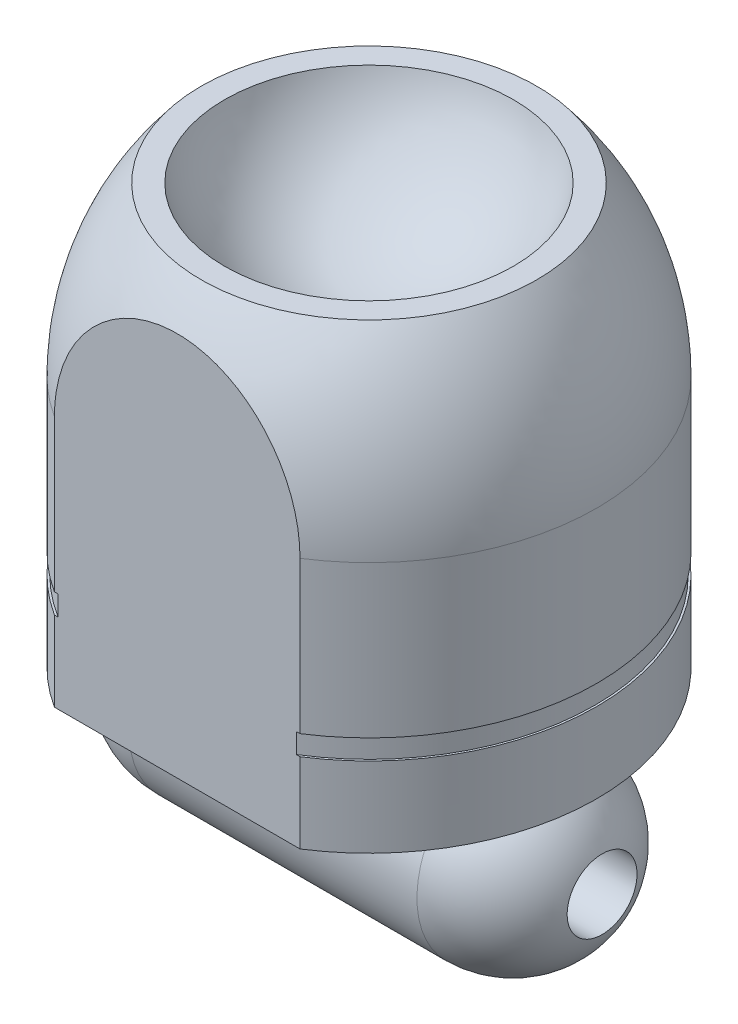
ISO-10303-21;
HEADER;
FILE_DESCRIPTION(('STEP AP214'),'2;1');
FILE_NAME('part.step','',(''),(''),'','','');
FILE_SCHEMA(('AUTOMOTIVE_DESIGN { 1 0 10303 214 1 1 1 1 }'));
ENDSEC;
DATA;
#1=APPLICATION_CONTEXT('core data for automotive mechanical design processes');
#2=APPLICATION_PROTOCOL_DEFINITION('international standard','automotive_design',2000,#1);
#3=PRODUCT_CONTEXT('',#1,'mechanical');
#4=PRODUCT('Part','Part','',(#3));
#5=PRODUCT_RELATED_PRODUCT_CATEGORY('part','',(#4));
#6=PRODUCT_DEFINITION_FORMATION('','',#4);
#7=PRODUCT_DEFINITION_CONTEXT('part definition',#1,'design');
#8=PRODUCT_DEFINITION('design','',#6,#7);
#9=PRODUCT_DEFINITION_SHAPE('','',#8);
#10=(LENGTH_UNIT() NAMED_UNIT(*) SI_UNIT(.MILLI.,.METRE.));
#11=(NAMED_UNIT(*) PLANE_ANGLE_UNIT() SI_UNIT($,.RADIAN.));
#12=(NAMED_UNIT(*) SI_UNIT($,.STERADIAN.) SOLID_ANGLE_UNIT());
#13=UNCERTAINTY_MEASURE_WITH_UNIT(LENGTH_MEASURE(1.E-05),#10,'distance_accuracy_value','');
#14=(GEOMETRIC_REPRESENTATION_CONTEXT(3) GLOBAL_UNCERTAINTY_ASSIGNED_CONTEXT((#13)) GLOBAL_UNIT_ASSIGNED_CONTEXT((#10,
#11,#12)) REPRESENTATION_CONTEXT('',''));
#15=CARTESIAN_POINT('',(0.,0.,0.));
#16=DIRECTION('',(0.,0.,1.));
#17=DIRECTION('',(1.,0.,0.));
#18=AXIS2_PLACEMENT_3D('',#15,#16,#17);
#19=CARTESIAN_POINT('',(0.,210.,0.));
#20=DIRECTION('',(0.,1.,0.));
#21=DIRECTION('',(-1.,0.,0.));
#22=AXIS2_PLACEMENT_3D('',#19,#20,#21);
#23=PLANE('',#22);
#24=CARTESIAN_POINT('',(0.,210.,0.));
#25=DIRECTION('',(0.,1.,0.));
#26=DIRECTION('',(-1.,0.,0.));
#27=AXIS2_PLACEMENT_3D('',#24,#25,#26);
#28=CIRCLE('',#27,84.);
#29=CARTESIAN_POINT('',(-84.,210.,0.));
#30=VERTEX_POINT('',#29);
#31=EDGE_CURVE('E255',#30,#30,#28,.T.);
#32=ORIENTED_EDGE('',*,*,#31,.T.);
#33=EDGE_LOOP('',(#32));
#34=FACE_BOUND('',#33,.T.);
#35=CARTESIAN_POINT('',(0.,210.,0.));
#36=DIRECTION('',(0.,1.,0.));
#37=DIRECTION('',(-1.,0.,0.));
#38=AXIS2_PLACEMENT_3D('',#35,#36,#37);
#39=CIRCLE('',#38,72.2841614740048);
#40=CARTESIAN_POINT('',(-72.2841614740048,210.,0.));
#41=VERTEX_POINT('',#40);
#42=EDGE_CURVE('E145',#41,#41,#39,.F.);
#43=ORIENTED_EDGE('',*,*,#42,.T.);
#44=EDGE_LOOP('',(#43));
#45=FACE_BOUND('',#44,.T.);
#46=ADVANCED_FACE('F40',(#34,#45),#23,.T.);
#47=CARTESIAN_POINT('',(0.,210.,0.));
#48=DIRECTION('',(0.,1.,0.));
#49=DIRECTION('',(-1.,0.,0.));
#50=AXIS2_PLACEMENT_3D('',#47,#48,#49);
#51=CYLINDRICAL_SURFACE('',#50,114.);
#52=CARTESIAN_POINT('',(0.,50.,0.));
#53=DIRECTION('',(0.,1.,0.));
#54=DIRECTION('',(-1.,0.,0.));
#55=AXIS2_PLACEMENT_3D('',#52,#53,#54);
#56=CIRCLE('',#55,114.);
#57=CARTESIAN_POINT('',(61.4817045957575,50.,96.));
#58=VERTEX_POINT('',#57);
#59=CARTESIAN_POINT('',(52.7205426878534,50.,-101.076923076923));
#60=VERTEX_POINT('',#59);
#61=EDGE_CURVE('E247',#58,#60,#56,.T.);
#62=ORIENTED_EDGE('',*,*,#61,.T.);
#63=CARTESIAN_POINT('',(0.,-169.,0.));
#64=DIRECTION('',(0.,-0.419058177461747,-0.907959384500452));
#65=DIRECTION('',(0.,0.907959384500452,-0.419058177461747));
#66=AXIS2_PLACEMENT_3D('',#63,#64,#65);
#67=ELLIPSE('',#66,272.038600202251,114.);
#68=CARTESIAN_POINT('',(-52.7205426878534,50.,-101.076923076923));
#69=VERTEX_POINT('',#68);
#70=EDGE_CURVE('E167',#60,#69,#67,.F.);
#71=ORIENTED_EDGE('',*,*,#70,.T.);
#72=CARTESIAN_POINT('',(-61.4817045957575,50.,96.));
#73=VERTEX_POINT('',#72);
#74=EDGE_CURVE('E252',#69,#73,#56,.T.);
#75=ORIENTED_EDGE('',*,*,#74,.T.);
#76=DIRECTION('',(0.,1.,0.));
#77=VECTOR('',#76,1.);
#78=CARTESIAN_POINT('',(-61.4817045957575,210.,96.));
#79=LINE('',#78,#77);
#80=CARTESIAN_POINT('',(-61.4817045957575,126.,96.));
#81=VERTEX_POINT('',#80);
#82=EDGE_CURVE('E194',#81,#73,#79,.F.);
#83=ORIENTED_EDGE('',*,*,#82,.F.);
#84=CARTESIAN_POINT('',(0.,126.,0.));
#85=DIRECTION('',(0.,1.,0.));
#86=DIRECTION('',(-1.,0.,0.));
#87=AXIS2_PLACEMENT_3D('',#84,#85,#86);
#88=CIRCLE('',#87,114.);
#89=CARTESIAN_POINT('',(61.4817045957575,126.,96.));
#90=VERTEX_POINT('',#89);
#91=EDGE_CURVE('E251',#90,#81,#88,.T.);
#92=ORIENTED_EDGE('',*,*,#91,.F.);
#93=DIRECTION('',(0.,1.,0.));
#94=VECTOR('',#93,1.);
#95=CARTESIAN_POINT('',(61.4817045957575,210.,96.));
#96=LINE('',#95,#94);
#97=EDGE_CURVE('E191',#58,#90,#96,.T.);
#98=ORIENTED_EDGE('',*,*,#97,.F.);
#99=EDGE_LOOP('',(#62,#71,#75,#83,#92,#98));
#100=FACE_BOUND('',#99,.T.);
#101=ADVANCED_FACE('F237',(#100),#51,.T.);
#102=CARTESIAN_POINT('',(-114.,50.,0.));
#103=DIRECTION('',(0.,-1.,0.));
#104=DIRECTION('',(1.,0.,0.));
#105=AXIS2_PLACEMENT_3D('',#102,#103,#104);
#106=PLANE('',#105);
#107=ORIENTED_EDGE('',*,*,#74,.F.);
#108=DIRECTION('',(1.,0.,0.));
#109=VECTOR('',#108,1.);
#110=CARTESIAN_POINT('',(-114.,50.,-101.076923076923));
#111=LINE('',#110,#109);
#112=CARTESIAN_POINT('',(-50.5218331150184,50.,-101.076923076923));
#113=VERTEX_POINT('',#112);
#114=EDGE_CURVE('E168',#69,#113,#111,.T.);
#115=ORIENTED_EDGE('',*,*,#114,.T.);
#116=CARTESIAN_POINT('',(0.,50.,0.));
#117=DIRECTION('',(0.,1.,0.));
#118=DIRECTION('',(-1.,0.,0.));
#119=AXIS2_PLACEMENT_3D('',#116,#117,#118);
#120=CIRCLE('',#119,113.);
#121=CARTESIAN_POINT('',(-59.6070465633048,50.,96.));
#122=VERTEX_POINT('',#121);
#123=EDGE_CURVE('E417',#113,#122,#120,.T.);
#124=ORIENTED_EDGE('',*,*,#123,.T.);
#125=DIRECTION('',(1.,0.,0.));
#126=VECTOR('',#125,1.);
#127=CARTESIAN_POINT('',(-114.,50.,96.));
#128=LINE('',#127,#126);
#129=EDGE_CURVE('E190',#73,#122,#128,.T.);
#130=ORIENTED_EDGE('',*,*,#129,.F.);
#131=EDGE_LOOP('',(#107,#115,#124,#130));
#132=FACE_BOUND('',#131,.T.);
#133=ADVANCED_FACE('F235',(#132),#106,.T.);
#134=CARTESIAN_POINT('',(59.6070465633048,50.,96.));
#135=VERTEX_POINT('',#134);
#136=CARTESIAN_POINT('',(50.5218331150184,50.,-101.076923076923));
#137=VERTEX_POINT('',#136);
#138=EDGE_CURVE('E257',#135,#137,#120,.T.);
#139=ORIENTED_EDGE('',*,*,#138,.T.);
#140=EDGE_CURVE('E163',#137,#60,#111,.T.);
#141=ORIENTED_EDGE('',*,*,#140,.T.);
#142=ORIENTED_EDGE('',*,*,#61,.F.);
#143=EDGE_CURVE('E187',#135,#58,#128,.T.);
#144=ORIENTED_EDGE('',*,*,#143,.F.);
#145=EDGE_LOOP('',(#139,#141,#142,#144));
#146=FACE_BOUND('',#145,.T.);
#147=ADVANCED_FACE('F233',(#146),#106,.T.);
#148=CARTESIAN_POINT('',(0.,210.,0.));
#149=DIRECTION('',(0.,1.,0.));
#150=DIRECTION('',(-1.,0.,0.));
#151=AXIS2_PLACEMENT_3D('',#148,#149,#150);
#152=CYLINDRICAL_SURFACE('',#151,113.);
#153=ORIENTED_EDGE('',*,*,#123,.F.);
#154=CARTESIAN_POINT('',(0.,-169.,0.));
#155=DIRECTION('',(0.,-0.419058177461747,-0.907959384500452));
#156=DIRECTION('',(0.,0.907959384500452,-0.419058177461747));
#157=AXIS2_PLACEMENT_3D('',#154,#155,#156);
#158=ELLIPSE('',#157,269.652296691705,113.);
#159=CARTESIAN_POINT('',(-58.8572136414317,40.,-96.4615384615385));
#160=VERTEX_POINT('',#159);
#161=EDGE_CURVE('E164',#113,#160,#158,.F.);
#162=ORIENTED_EDGE('',*,*,#161,.T.);
#163=CARTESIAN_POINT('',(0.,40.,0.));
#164=DIRECTION('',(0.,1.,0.));
#165=DIRECTION('',(-1.,0.,0.));
#166=AXIS2_PLACEMENT_3D('',#163,#164,#165);
#167=CIRCLE('',#166,113.);
#168=CARTESIAN_POINT('',(-59.6070465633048,40.,96.));
#169=VERTEX_POINT('',#168);
#170=EDGE_CURVE('E423',#160,#169,#167,.T.);
#171=ORIENTED_EDGE('',*,*,#170,.T.);
#172=DIRECTION('',(0.,1.,0.));
#173=VECTOR('',#172,1.);
#174=CARTESIAN_POINT('',(-59.6070465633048,210.,96.));
#175=LINE('',#174,#173);
#176=EDGE_CURVE('E184',#122,#169,#175,.F.);
#177=ORIENTED_EDGE('',*,*,#176,.F.);
#178=EDGE_LOOP('',(#153,#162,#171,#177));
#179=FACE_BOUND('',#178,.T.);
#180=ADVANCED_FACE('F230',(#179),#152,.T.);
#181=CARTESIAN_POINT('',(59.6070465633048,40.,96.));
#182=VERTEX_POINT('',#181);
#183=CARTESIAN_POINT('',(58.8572136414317,40.,-96.4615384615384));
#184=VERTEX_POINT('',#183);
#185=EDGE_CURVE('E418',#182,#184,#167,.T.);
#186=ORIENTED_EDGE('',*,*,#185,.T.);
#187=EDGE_CURVE('E159',#184,#137,#158,.F.);
#188=ORIENTED_EDGE('',*,*,#187,.T.);
#189=ORIENTED_EDGE('',*,*,#138,.F.);
#190=DIRECTION('',(0.,1.,0.));
#191=VECTOR('',#190,1.);
#192=CARTESIAN_POINT('',(59.6070465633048,210.,96.));
#193=LINE('',#192,#191);
#194=EDGE_CURVE('E181',#182,#135,#193,.T.);
#195=ORIENTED_EDGE('',*,*,#194,.F.);
#196=EDGE_LOOP('',(#186,#188,#189,#195));
#197=FACE_BOUND('',#196,.T.);
#198=ADVANCED_FACE('F228',(#197),#152,.T.);
#199=CARTESIAN_POINT('',(-114.,40.,0.));
#200=DIRECTION('',(0.,1.,0.));
#201=DIRECTION('',(-1.,0.,0.));
#202=AXIS2_PLACEMENT_3D('',#199,#200,#201);
#203=PLANE('',#202);
#204=CARTESIAN_POINT('',(0.,40.,0.));
#205=DIRECTION('',(0.,1.,0.));
#206=DIRECTION('',(-1.,0.,0.));
#207=AXIS2_PLACEMENT_3D('',#204,#205,#206);
#208=CIRCLE('',#207,114.);
#209=CARTESIAN_POINT('',(61.4817045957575,40.,96.));
#210=VERTEX_POINT('',#209);
#211=CARTESIAN_POINT('',(60.7550129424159,40.,-96.4615384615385));
#212=VERTEX_POINT('',#211);
#213=EDGE_CURVE('E424',#210,#212,#208,.T.);
#214=ORIENTED_EDGE('',*,*,#213,.T.);
#215=DIRECTION('',(-1.,0.,0.));
#216=VECTOR('',#215,1.);
#217=CARTESIAN_POINT('',(-114.,40.,-96.4615384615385));
#218=LINE('',#217,#216);
#219=EDGE_CURVE('E155',#212,#184,#218,.T.);
#220=ORIENTED_EDGE('',*,*,#219,.T.);
#221=ORIENTED_EDGE('',*,*,#185,.F.);
#222=DIRECTION('',(-1.,0.,0.));
#223=VECTOR('',#222,1.);
#224=CARTESIAN_POINT('',(-114.,40.,96.));
#225=LINE('',#224,#223);
#226=EDGE_CURVE('E180',#210,#182,#225,.T.);
#227=ORIENTED_EDGE('',*,*,#226,.F.);
#228=EDGE_LOOP('',(#214,#220,#221,#227));
#229=FACE_BOUND('',#228,.T.);
#230=ADVANCED_FACE('F225',(#229),#203,.T.);
#231=ORIENTED_EDGE('',*,*,#170,.F.);
#232=CARTESIAN_POINT('',(-60.755012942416,40.,-96.4615384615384));
#233=VERTEX_POINT('',#232);
#234=EDGE_CURVE('E160',#160,#233,#218,.T.);
#235=ORIENTED_EDGE('',*,*,#234,.T.);
#236=CARTESIAN_POINT('',(-61.4817045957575,40.,96.));
#237=VERTEX_POINT('',#236);
#238=EDGE_CURVE('E426',#233,#237,#208,.T.);
#239=ORIENTED_EDGE('',*,*,#238,.T.);
#240=EDGE_CURVE('E177',#169,#237,#225,.T.);
#241=ORIENTED_EDGE('',*,*,#240,.F.);
#242=EDGE_LOOP('',(#231,#235,#239,#241));
#243=FACE_BOUND('',#242,.T.);
#244=ADVANCED_FACE('F223',(#243),#203,.T.);
#245=CARTESIAN_POINT('',(0.,210.,0.));
#246=DIRECTION('',(0.,1.,0.));
#247=DIRECTION('',(-1.,0.,0.));
#248=AXIS2_PLACEMENT_3D('',#245,#246,#247);
#249=CYLINDRICAL_SURFACE('',#248,114.);
#250=ORIENTED_EDGE('',*,*,#238,.F.);
#251=CARTESIAN_POINT('',(0.,-169.,0.));
#252=DIRECTION('',(0.,-0.419058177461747,-0.907959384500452));
#253=DIRECTION('',(0.,0.907959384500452,-0.419058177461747));
#254=AXIS2_PLACEMENT_3D('',#251,#252,#253);
#255=ELLIPSE('',#254,272.038600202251,114.);
#256=CARTESIAN_POINT('',(-83.1384387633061,0.,-78.));
#257=VERTEX_POINT('',#256);
#258=EDGE_CURVE('E156',#233,#257,#255,.F.);
#259=ORIENTED_EDGE('',*,*,#258,.T.);
#260=CARTESIAN_POINT('',(0.,0.,0.));
#261=DIRECTION('',(0.,1.,0.));
#262=DIRECTION('',(-1.,0.,0.));
#263=AXIS2_PLACEMENT_3D('',#260,#261,#262);
#264=CIRCLE('',#263,114.);
#265=CARTESIAN_POINT('',(-61.4817045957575,0.,96.));
#266=VERTEX_POINT('',#265);
#267=EDGE_CURVE('E203',#257,#266,#264,.T.);
#268=ORIENTED_EDGE('',*,*,#267,.T.);
#269=DIRECTION('',(0.,1.,0.));
#270=VECTOR('',#269,1.);
#271=CARTESIAN_POINT('',(-61.4817045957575,210.,96.));
#272=LINE('',#271,#270);
#273=EDGE_CURVE('E174',#237,#266,#272,.F.);
#274=ORIENTED_EDGE('',*,*,#273,.F.);
#275=EDGE_LOOP('',(#250,#259,#268,#274));
#276=FACE_BOUND('',#275,.T.);
#277=ADVANCED_FACE('F220',(#276),#249,.T.);
#278=CARTESIAN_POINT('',(61.4817045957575,0.,96.));
#279=VERTEX_POINT('',#278);
#280=CARTESIAN_POINT('',(83.1384387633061,0.,-78.));
#281=VERTEX_POINT('',#280);
#282=EDGE_CURVE('E204',#279,#281,#264,.T.);
#283=ORIENTED_EDGE('',*,*,#282,.T.);
#284=EDGE_CURVE('E152',#281,#212,#255,.F.);
#285=ORIENTED_EDGE('',*,*,#284,.T.);
#286=ORIENTED_EDGE('',*,*,#213,.F.);
#287=DIRECTION('',(0.,1.,0.));
#288=VECTOR('',#287,1.);
#289=CARTESIAN_POINT('',(61.4817045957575,210.,96.));
#290=LINE('',#289,#288);
#291=EDGE_CURVE('E171',#279,#210,#290,.T.);
#292=ORIENTED_EDGE('',*,*,#291,.F.);
#293=EDGE_LOOP('',(#283,#285,#286,#292));
#294=FACE_BOUND('',#293,.T.);
#295=ADVANCED_FACE('F219',(#294),#249,.T.);
#296=CARTESIAN_POINT('',(0.,0.,0.));
#297=DIRECTION('',(0.,-1.,0.));
#298=DIRECTION('',(1.,0.,0.));
#299=AXIS2_PLACEMENT_3D('',#296,#297,#298);
#300=PLANE('',#299);
#301=CARTESIAN_POINT('',(72.,0.,0.));
#302=DIRECTION('',(0.,-1.,0.));
#303=DIRECTION('',(1.,0.,0.));
#304=AXIS2_PLACEMENT_3D('',#301,#302,#303);
#305=CIRCLE('',#304,26.5329983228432);
#306=CARTESIAN_POINT('',(72.,0.,-26.5329983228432));
#307=VERTEX_POINT('',#306);
#308=CARTESIAN_POINT('',(72.,0.,26.5329983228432));
#309=VERTEX_POINT('',#308);
#310=EDGE_CURVE('E11',#307,#309,#305,.T.);
#311=ORIENTED_EDGE('',*,*,#310,.F.);
#312=DIRECTION('',(1.,0.,0.));
#313=VECTOR('',#312,1.);
#314=CARTESIAN_POINT('',(132.57868875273,0.,-26.5329983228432));
#315=LINE('',#314,#313);
#316=CARTESIAN_POINT('',(-72.,0.,-26.5329983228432));
#317=VERTEX_POINT('',#316);
#318=EDGE_CURVE('E47',#317,#307,#315,.T.);
#319=ORIENTED_EDGE('',*,*,#318,.F.);
#320=CARTESIAN_POINT('',(-72.,0.,0.));
#321=DIRECTION('',(0.,-1.,0.));
#322=DIRECTION('',(1.,0.,0.));
#323=AXIS2_PLACEMENT_3D('',#320,#321,#322);
#324=CIRCLE('',#323,26.5329983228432);
#325=CARTESIAN_POINT('',(-72.,0.,26.5329983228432));
#326=VERTEX_POINT('',#325);
#327=EDGE_CURVE('E130',#326,#317,#324,.T.);
#328=ORIENTED_EDGE('',*,*,#327,.F.);
#329=DIRECTION('',(1.,0.,0.));
#330=VECTOR('',#329,1.);
#331=CARTESIAN_POINT('',(132.57868875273,0.,26.5329983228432));
#332=LINE('',#331,#330);
#333=EDGE_CURVE('E57',#309,#326,#332,.F.);
#334=ORIENTED_EDGE('',*,*,#333,.F.);
#335=EDGE_LOOP('',(#311,#319,#328,#334));
#336=FACE_BOUND('',#335,.T.);
#337=ORIENTED_EDGE('',*,*,#267,.F.);
#338=DIRECTION('',(1.,0.,0.));
#339=VECTOR('',#338,1.);
#340=CARTESIAN_POINT('',(0.,0.,-78.));
#341=LINE('',#340,#339);
#342=EDGE_CURVE('E139',#257,#281,#341,.T.);
#343=ORIENTED_EDGE('',*,*,#342,.T.);
#344=ORIENTED_EDGE('',*,*,#282,.F.);
#345=DIRECTION('',(1.,0.,0.));
#346=VECTOR('',#345,1.);
#347=CARTESIAN_POINT('',(0.,0.,96.));
#348=LINE('',#347,#346);
#349=EDGE_CURVE('E263',#266,#279,#348,.T.);
#350=ORIENTED_EDGE('',*,*,#349,.F.);
#351=EDGE_LOOP('',(#337,#343,#344,#350));
#352=FACE_BOUND('',#351,.T.);
#353=ADVANCED_FACE('F128',(#336,#352),#300,.T.);
#354=CARTESIAN_POINT('',(0.,126.,0.));
#355=DIRECTION('',(0.,1.,0.));
#356=DIRECTION('',(-1.,0.,0.));
#357=AXIS2_PLACEMENT_3D('',#354,#355,#356);
#358=DEGENERATE_TOROIDAL_SURFACE('',#357,18.6000000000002,132.6,.F.);
#359=CARTESIAN_POINT('',(0.,192.705322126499,96.));
#360=CARTESIAN_POINT('',(-1.62232539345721,192.705305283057,96.));
#361=CARTESIAN_POINT('',(-3.245032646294,192.634572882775,96.));
#362=CARTESIAN_POINT('',(-6.47846738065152,192.352444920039,96.));
#363=CARTESIAN_POINT('',(-8.08919088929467,192.14100464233,96.));
#364=CARTESIAN_POINT('',(-11.2884724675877,191.579679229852,96.));
#365=CARTESIAN_POINT('',(-12.8769995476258,191.229617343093,96.));
#366=CARTESIAN_POINT('',(-16.0181997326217,190.395245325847,96.));
#367=CARTESIAN_POINT('',(-17.5708754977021,189.910945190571,96.));
#368=CARTESIAN_POINT('',(-20.6257342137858,188.815075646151,96.));
#369=CARTESIAN_POINT('',(-22.1280448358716,188.203861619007,96.));
#370=CARTESIAN_POINT('',(-25.0771733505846,186.859789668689,96.));
#371=CARTESIAN_POINT('',(-26.5239904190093,186.126929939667,96.));
#372=CARTESIAN_POINT('',(-29.3533997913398,184.546861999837,96.));
#373=CARTESIAN_POINT('',(-30.7360026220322,183.699672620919,96.));
#374=CARTESIAN_POINT('',(-33.429720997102,181.898544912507,96.));
#375=CARTESIAN_POINT('',(-34.740834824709,180.944604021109,96.));
#376=CARTESIAN_POINT('',(-37.3361760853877,178.89751774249,96.));
#377=CARTESIAN_POINT('',(-38.6172206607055,177.80032589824,96.));
#378=CARTESIAN_POINT('',(-40.4703488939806,176.081495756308,96.));
#379=CARTESIAN_POINT('',(-41.0766851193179,175.4963425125,96.));
#380=CARTESIAN_POINT('',(-42.2660831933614,174.302615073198,96.));
#381=CARTESIAN_POINT('',(-42.849140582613,173.694036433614,96.));
#382=CARTESIAN_POINT('',(-44.562258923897,171.834936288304,96.));
#383=CARTESIAN_POINT('',(-45.6563708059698,170.550953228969,96.));
#384=CARTESIAN_POINT('',(-47.743436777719,167.903410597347,96.));
#385=CARTESIAN_POINT('',(-48.7363823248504,166.539844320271,96.));
#386=CARTESIAN_POINT('',(-50.6938087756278,163.628010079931,96.));
#387=CARTESIAN_POINT('',(-51.649383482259,162.073744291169,96.));
#388=CARTESIAN_POINT('',(-53.4332489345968,158.893816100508,96.));
#389=CARTESIAN_POINT('',(-54.2615335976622,157.268150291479,96.));
#390=CARTESIAN_POINT('',(-55.7874312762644,153.95619437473,96.));
#391=CARTESIAN_POINT('',(-56.485011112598,152.269889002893,96.));
#392=CARTESIAN_POINT('',(-57.7464196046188,148.84776991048,96.));
#393=CARTESIAN_POINT('',(-58.3102446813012,147.111954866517,96.));
#394=CARTESIAN_POINT('',(-59.0697824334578,144.42334751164,96.));
#395=CARTESIAN_POINT('',(-59.314319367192,143.484080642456,96.));
#396=CARTESIAN_POINT('',(-59.7645564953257,141.596515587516,96.));
#397=CARTESIAN_POINT('',(-59.9702654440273,140.648219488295,96.));
#398=CARTESIAN_POINT('',(-60.5288946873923,137.791665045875,96.));
#399=CARTESIAN_POINT('',(-60.8233468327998,135.871636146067,96.));
#400=CARTESIAN_POINT('',(-61.2548225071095,132.013887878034,96.));
#401=CARTESIAN_POINT('',(-61.3918190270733,130.076165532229,96.));
#402=CARTESIAN_POINT('',(-61.5077716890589,126.195934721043,96.));
#403=CARTESIAN_POINT('',(-61.4867262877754,124.253426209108,96.));
#404=CARTESIAN_POINT('',(-61.2834582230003,120.314586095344,96.));
#405=CARTESIAN_POINT('',(-61.0961080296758,118.318517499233,96.));
#406=CARTESIAN_POINT('',(-60.5540318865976,114.349175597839,96.));
#407=CARTESIAN_POINT('',(-60.1993013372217,112.375902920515,96.));
#408=CARTESIAN_POINT('',(-59.3240784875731,108.466238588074,96.));
#409=CARTESIAN_POINT('',(-58.8035706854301,106.529850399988,96.));
#410=CARTESIAN_POINT('',(-57.5992883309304,102.708505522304,96.));
#411=CARTESIAN_POINT('',(-56.9155158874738,100.823548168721,96.));
#412=CARTESIAN_POINT('',(-55.3917289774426,97.128438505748,96.));
#413=CARTESIAN_POINT('',(-54.5524820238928,95.3179699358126,96.));
#414=CARTESIAN_POINT('',(-52.7198144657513,91.776711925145,96.));
#415=CARTESIAN_POINT('',(-51.7263923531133,90.0459232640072,96.));
#416=CARTESIAN_POINT('',(-49.5906829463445,86.6787892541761,96.));
#417=CARTESIAN_POINT('',(-48.4484029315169,85.0424392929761,96.));
#418=CARTESIAN_POINT('',(-46.0213617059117,81.879002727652,96.));
#419=CARTESIAN_POINT('',(-44.7366073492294,80.3519108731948,96.));
#420=CARTESIAN_POINT('',(-42.0919839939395,77.4866029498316,96.));
#421=CARTESIAN_POINT('',(-40.7379206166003,76.1430289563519,96.));
#422=CARTESIAN_POINT('',(-37.9147002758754,73.5826162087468,96.));
#423=CARTESIAN_POINT('',(-36.4455450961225,72.3657754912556,96.));
#424=CARTESIAN_POINT('',(-33.4023397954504,70.072454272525,96.));
#425=CARTESIAN_POINT('',(-31.8283343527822,68.9959145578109,96.));
#426=CARTESIAN_POINT('',(-28.5861386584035,66.9954240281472,96.));
#427=CARTESIAN_POINT('',(-26.9179564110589,66.0714602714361,96.));
#428=CARTESIAN_POINT('',(-23.6349532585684,64.4543518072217,96.));
#429=CARTESIAN_POINT('',(-22.0262520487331,63.7487696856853,96.));
#430=CARTESIAN_POINT('',(-18.7516442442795,62.485806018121,96.));
#431=CARTESIAN_POINT('',(-17.0857406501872,61.9284167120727,96.));
#432=CARTESIAN_POINT('',(-13.7106061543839,60.9693116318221,96.));
#433=CARTESIAN_POINT('',(-12.0013985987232,60.56751380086,96.));
#434=CARTESIAN_POINT('',(-8.5530142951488,59.9247181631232,96.));
#435=CARTESIAN_POINT('',(-6.8138394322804,59.6837102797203,96.));
#436=CARTESIAN_POINT('',(-3.45867515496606,59.378456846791,96.));
#437=CARTESIAN_POINT('',(-1.84380788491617,59.301751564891,96.));
#438=CARTESIAN_POINT('',(1.38644069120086,59.2885400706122,96.));
#439=CARTESIAN_POINT('',(3.00182195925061,59.3520251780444,96.));
#440=CARTESIAN_POINT('',(6.2208028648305,59.6183806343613,96.));
#441=CARTESIAN_POINT('',(7.82440404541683,59.821232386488,96.));
#442=CARTESIAN_POINT('',(11.0082606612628,60.3638289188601,96.));
#443=CARTESIAN_POINT('',(12.5885159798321,60.7035743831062,96.));
#444=CARTESIAN_POINT('',(15.677617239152,61.5063800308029,96.));
#445=CARTESIAN_POINT('',(17.1872684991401,61.9663496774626,96.));
#446=CARTESIAN_POINT('',(20.1638621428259,63.0080577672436,96.));
#447=CARTESIAN_POINT('',(21.6308055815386,63.5897931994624,96.));
#448=CARTESIAN_POINT('',(24.5133275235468,64.8692745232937,96.));
#449=CARTESIAN_POINT('',(25.9289006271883,65.5670325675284,96.));
#450=CARTESIAN_POINT('',(28.700564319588,67.0719606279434,96.));
#451=CARTESIAN_POINT('',(30.0566526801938,67.8791347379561,96.));
#452=CARTESIAN_POINT('',(32.7642502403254,69.6361525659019,96.));
#453=CARTESIAN_POINT('',(34.1125881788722,70.5908985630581,96.));
#454=CARTESIAN_POINT('',(36.0747489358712,72.1006306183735,96.));
#455=CARTESIAN_POINT('',(36.7187819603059,72.6168437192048,96.));
#456=CARTESIAN_POINT('',(37.9862032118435,73.6742642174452,96.));
#457=CARTESIAN_POINT('',(38.6095874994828,74.2154763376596,96.));
#458=CARTESIAN_POINT('',(40.4475043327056,75.874955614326,96.));
#459=CARTESIAN_POINT('',(41.6299174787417,77.0291555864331,96.));
#460=CARTESIAN_POINT('',(43.9031656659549,79.424296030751,96.));
#461=CARTESIAN_POINT('',(44.9939927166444,80.6652440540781,96.));
#462=CARTESIAN_POINT('',(47.1625791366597,83.3273167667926,96.));
#463=CARTESIAN_POINT('',(48.2323962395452,84.7549215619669,96.));
#464=CARTESIAN_POINT('',(50.2550973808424,87.6906776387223,96.));
#465=CARTESIAN_POINT('',(51.207976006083,89.1988326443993,96.));
#466=CARTESIAN_POINT('',(52.9928534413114,92.285445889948,96.));
#467=CARTESIAN_POINT('',(53.8248228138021,93.8639211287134,96.));
#468=CARTESIAN_POINT('',(55.3642532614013,97.0806666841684,96.));
#469=CARTESIAN_POINT('',(56.0717101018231,98.718939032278,96.));
#470=CARTESIAN_POINT('',(57.060289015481,101.272558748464,96.));
#471=CARTESIAN_POINT('',(57.3868974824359,102.170559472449,96.));
#472=CARTESIAN_POINT('',(58.0031221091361,103.978933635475,96.));
#473=CARTESIAN_POINT('',(58.2927465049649,104.889304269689,96.));
#474=CARTESIAN_POINT('',(59.105801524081,107.637160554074,96.));
#475=CARTESIAN_POINT('',(59.5734493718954,109.49148214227,96.));
#476=CARTESIAN_POINT('',(60.3576951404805,113.231933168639,96.));
#477=CARTESIAN_POINT('',(60.6742623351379,115.118068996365,96.));
#478=CARTESIAN_POINT('',(61.1549607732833,118.9097228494,96.));
#479=CARTESIAN_POINT('',(61.3190897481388,120.815241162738,96.));
#480=CARTESIAN_POINT('',(61.4978763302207,124.713834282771,96.));
#481=CARTESIAN_POINT('',(61.5059410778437,126.707213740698,96.));
#482=CARTESIAN_POINT('',(61.3556783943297,130.687743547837,96.));
#483=CARTESIAN_POINT('',(61.1973455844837,132.674893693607,96.));
#484=CARTESIAN_POINT('',(60.7149750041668,136.629232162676,96.));
#485=CARTESIAN_POINT('',(60.3909182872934,138.596418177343,96.));
#486=CARTESIAN_POINT('',(59.5785860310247,142.496600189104,96.));
#487=CARTESIAN_POINT('',(59.0903113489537,144.429596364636,96.));
#488=CARTESIAN_POINT('',(57.9482448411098,148.259368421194,96.));
#489=CARTESIAN_POINT('',(57.2934306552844,150.155839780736,96.));
#490=CARTESIAN_POINT('',(55.8230032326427,153.885479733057,96.));
#491=CARTESIAN_POINT('',(55.00738749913,155.718647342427,96.));
#492=CARTESIAN_POINT('',(53.2195124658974,159.306949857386,96.));
#493=CARTESIAN_POINT('',(52.2472568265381,161.062086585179,96.));
#494=CARTESIAN_POINT('',(50.151225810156,164.479492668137,96.));
#495=CARTESIAN_POINT('',(49.0274561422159,166.141765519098,96.));
#496=CARTESIAN_POINT('',(46.6736777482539,169.306045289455,96.));
#497=CARTESIAN_POINT('',(45.448306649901,170.811504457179,96.));
#498=CARTESIAN_POINT('',(42.8682562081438,173.707823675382,96.));
#499=CARTESIAN_POINT('',(41.5135770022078,175.098683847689,96.));
#500=CARTESIAN_POINT('',(39.3913823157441,177.088044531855,96.));
#501=CARTESIAN_POINT('',(38.6688349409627,177.735103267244,96.));
#502=CARTESIAN_POINT('',(37.194740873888,178.995293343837,96.));
#503=CARTESIAN_POINT('',(36.4431966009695,179.608427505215,96.));
#504=CARTESIAN_POINT('',(34.9125237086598,180.798919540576,96.));
#505=CARTESIAN_POINT('',(34.1334007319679,181.376284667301,96.));
#506=CARTESIAN_POINT('',(32.5486190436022,182.493823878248,96.));
#507=CARTESIAN_POINT('',(31.7429519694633,183.033986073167,96.));
#508=CARTESIAN_POINT('',(29.4029247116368,184.523159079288,96.));
#509=CARTESIAN_POINT('',(27.837717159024,185.424309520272,96.));
#510=CARTESIAN_POINT('',(24.632072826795,187.080942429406,96.));
#511=CARTESIAN_POINT('',(22.9916449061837,187.836441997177,96.));
#512=CARTESIAN_POINT('',(20.4858108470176,188.852713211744,96.));
#513=CARTESIAN_POINT('',(19.6436573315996,189.171775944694,96.));
#514=CARTESIAN_POINT('',(17.945515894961,189.770218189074,96.));
#515=CARTESIAN_POINT('',(17.0895312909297,190.049607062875,96.));
#516=CARTESIAN_POINT('',(15.3656280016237,190.567716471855,96.));
#517=CARTESIAN_POINT('',(14.4977129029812,190.806448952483,96.));
#518=CARTESIAN_POINT('',(12.7515783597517,191.242500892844,96.));
#519=CARTESIAN_POINT('',(11.8733594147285,191.439822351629,96.));
#520=CARTESIAN_POINT('',(10.086767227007,191.796687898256,96.));
#521=CARTESIAN_POINT('',(9.17818397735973,191.955182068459,96.));
#522=CARTESIAN_POINT('',(7.35458135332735,192.227295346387,96.));
#523=CARTESIAN_POINT('',(6.43956382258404,192.340926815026,96.));
#524=CARTESIAN_POINT('',(4.6049461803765,192.52293004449,96.));
#525=CARTESIAN_POINT('',(3.68534571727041,192.591298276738,96.));
#526=CARTESIAN_POINT('',(1.84387141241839,192.682501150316,96.));
#527=CARTESIAN_POINT('',(0.921997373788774,192.705331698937,96.));
#528=CARTESIAN_POINT('',(0.,192.705322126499,96.));
#529=B_SPLINE_CURVE_WITH_KNOTS('',3,(#359,#360,#361,#362,#363,#364,#365,#366,#367,#368,#369,
#370,#371,#372,#373,#374,#375,#376,#377,#378,#379,#380,#381,#382,#383,#384,#385,#386,#387,#388,
#389,#390,#391,#392,#393,#394,#395,#396,#397,#398,#399,#400,#401,#402,#403,#404,#405,#406,#407,
#408,#409,#410,#411,#412,#413,#414,#415,#416,#417,#418,#419,#420,#421,#422,#423,#424,#425,#426,
#427,#428,#429,#430,#431,#432,#433,#434,#435,#436,#437,#438,#439,#440,#441,#442,#443,#444,#445,
#446,#447,#448,#449,#450,#451,#452,#453,#454,#455,#456,#457,#458,#459,#460,#461,#462,#463,#464,
#465,#466,#467,#468,#469,#470,#471,#472,#473,#474,#475,#476,#477,#478,#479,#480,#481,#482,#483,
#484,#485,#486,#487,#488,#489,#490,#491,#492,#493,#494,#495,#496,#497,#498,#499,#500,#501,#502,
#503,#504,#505,#506,#507,#508,#509,#510,#511,#512,#513,#514,#515,#516,#517,#518,#519,#520,#521,
#522,#523,#524,#525,#526,#527,#528),.UNSPECIFIED.,.T.,.F.,(4,2,2,2,2,2,2,2,2,2,2,2,2,2,2,2,2,2,
2,2,2,2,2,2,2,2,2,2,2,2,2,2,2,2,2,2,2,2,2,2,2,2,2,2,2,2,2,2,2,2,2,2,2,2,2,2,2,2,2,2,2,2,2,2,2,2,
2,2,2,2,2,2,2,2,2,2,2,2,2,2,2,2,2,2,4),(0.,4.86610418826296,9.7337555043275,14.6076334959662,
19.4811486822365,24.3411968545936,29.2013171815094,34.0606379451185,38.920075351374,
43.9742447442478,46.5016232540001,49.0294836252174,54.0847765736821,59.1404960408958,
64.6080157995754,70.0757967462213,75.5449638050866,81.0142771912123,83.9252851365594,
86.8356359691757,92.6560131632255,98.4773885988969,104.298820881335,110.306226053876,
116.313796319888,122.321928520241,128.32998311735,134.309132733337,140.288340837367,
146.26725666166,152.245884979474,157.961031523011,163.676089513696,169.388727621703,
175.100880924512,180.36384208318,185.626527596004,190.886433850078,196.146010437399,
200.990094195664,205.833878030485,210.677015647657,215.520177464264,220.249350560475,
224.978406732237,229.707958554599,234.437687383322,239.388292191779,241.863894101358,
244.339965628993,249.291668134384,254.243802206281,259.589872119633,264.936189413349,
270.283806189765,275.631604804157,278.497553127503,281.362862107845,287.093186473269,
292.82467575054,298.556250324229,304.529447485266,310.502837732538,316.476911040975,
322.45095316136,328.462593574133,334.474327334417,340.485920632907,346.49728747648,
352.313356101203,358.129418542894,361.038358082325,363.94705543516,366.855161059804,
369.764191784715,375.174800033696,380.584772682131,383.285660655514,385.985910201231,
388.685364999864,391.384689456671,394.15048455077,396.91551705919,399.680765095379,
402.446261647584),.UNSPECIFIED.);
#530=EDGE_CURVE('E197',#90,#81,#529,.T.);
#531=ORIENTED_EDGE('',*,*,#530,.F.);
#532=ORIENTED_EDGE('',*,*,#91,.T.);
#533=EDGE_LOOP('',(#531,#532));
#534=FACE_BOUND('',#533,.T.);
#535=ORIENTED_EDGE('',*,*,#31,.F.);
#536=EDGE_LOOP('',(#535));
#537=FACE_BOUND('',#536,.T.);
#538=ADVANCED_FACE('F206',(#534,#537),#358,.F.);
#539=CARTESIAN_POINT('',(585.995062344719,234.022907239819,96.));
#540=DIRECTION('',(0.,0.,-1.));
#541=DIRECTION('',(0.,1.,0.));
#542=AXIS2_PLACEMENT_3D('',#539,#540,#541);
#543=PLANE('',#542);
#544=ORIENTED_EDGE('',*,*,#97,.T.);
#545=ORIENTED_EDGE('',*,*,#530,.T.);
#546=ORIENTED_EDGE('',*,*,#82,.T.);
#547=ORIENTED_EDGE('',*,*,#129,.T.);
#548=ORIENTED_EDGE('',*,*,#176,.T.);
#549=ORIENTED_EDGE('',*,*,#240,.T.);
#550=ORIENTED_EDGE('',*,*,#273,.T.);
#551=ORIENTED_EDGE('',*,*,#349,.T.);
#552=ORIENTED_EDGE('',*,*,#291,.T.);
#553=ORIENTED_EDGE('',*,*,#226,.T.);
#554=ORIENTED_EDGE('',*,*,#194,.T.);
#555=ORIENTED_EDGE('',*,*,#143,.T.);
#556=EDGE_LOOP('',(#544,#545,#546,#547,#548,#549,#550,#551,#552,#553,#554,#555));
#557=FACE_BOUND('',#556,.T.);
#558=ADVANCED_FACE('F209',(#557),#543,.F.);
#559=CARTESIAN_POINT('',(573.014422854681,78.,-114.));
#560=DIRECTION('',(0.,-0.419058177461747,-0.907959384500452));
#561=DIRECTION('',(0.,0.907959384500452,-0.419058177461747));
#562=AXIS2_PLACEMENT_3D('',#559,#560,#561);
#563=PLANE('',#562);
#564=ORIENTED_EDGE('',*,*,#258,.F.);
#565=ORIENTED_EDGE('',*,*,#234,.F.);
#566=ORIENTED_EDGE('',*,*,#161,.F.);
#567=ORIENTED_EDGE('',*,*,#114,.F.);
#568=ORIENTED_EDGE('',*,*,#70,.F.);
#569=ORIENTED_EDGE('',*,*,#140,.F.);
#570=ORIENTED_EDGE('',*,*,#187,.F.);
#571=ORIENTED_EDGE('',*,*,#219,.F.);
#572=ORIENTED_EDGE('',*,*,#284,.F.);
#573=ORIENTED_EDGE('',*,*,#342,.F.);
#574=EDGE_LOOP('',(#564,#565,#566,#567,#568,#569,#570,#571,#572,#573));
#575=FACE_BOUND('',#574,.T.);
#576=ADVANCED_FACE('F214',(#575),#563,.T.);
#577=CARTESIAN_POINT('',(0.,230.,0.));
#578=DIRECTION('',(0.,-1.,0.));
#579=DIRECTION('',(-1.,0.,0.));
#580=AXIS2_PLACEMENT_3D('',#577,#578,#579);
#581=SPHERICAL_SURFACE('',#580,75.);
#582=ORIENTED_EDGE('',*,*,#42,.F.);
#583=EDGE_LOOP('',(#582));
#584=FACE_BOUND('',#583,.T.);
#585=ADVANCED_FACE('F273',(#584),#581,.F.);
#586=CARTESIAN_POINT('',(72.,-40.,0.));
#587=DIRECTION('',(1.,0.,0.));
#588=DIRECTION('',(0.,1.,0.));
#589=AXIS2_PLACEMENT_3D('',#586,#587,#588);
#590=SPHERICAL_SURFACE('',#589,48.);
#591=CARTESIAN_POINT('',(72.,-40.,0.));
#592=DIRECTION('',(1.,0.,0.));
#593=DIRECTION('',(0.,1.,0.));
#594=AXIS2_PLACEMENT_3D('',#591,#592,#593);
#595=CIRCLE('',#594,48.);
#596=EDGE_CURVE('E142',#309,#307,#595,.T.);
#597=ORIENTED_EDGE('',*,*,#596,.T.);
#598=ORIENTED_EDGE('',*,*,#310,.T.);
#599=EDGE_LOOP('',(#597,#598));
#600=FACE_BOUND('',#599,.T.);
#601=CARTESIAN_POINT('',(116.696196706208,-40.,0.));
#602=DIRECTION('',(1.,0.,0.));
#603=DIRECTION('',(0.,1.,0.));
#604=AXIS2_PLACEMENT_3D('',#601,#602,#603);
#605=CIRCLE('',#604,17.5);
#606=CARTESIAN_POINT('',(116.696196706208,-22.5,0.));
#607=VERTEX_POINT('',#606);
#608=EDGE_CURVE('E148',#607,#607,#605,.T.);
#609=ORIENTED_EDGE('',*,*,#608,.F.);
#610=EDGE_LOOP('',(#609));
#611=FACE_BOUND('',#610,.T.);
#612=ADVANCED_FACE('F275',(#600,#611),#590,.T.);
#613=CARTESIAN_POINT('',(132.57868875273,-40.,0.));
#614=DIRECTION('',(1.,0.,0.));
#615=DIRECTION('',(0.,1.,0.));
#616=AXIS2_PLACEMENT_3D('',#613,#614,#615);
#617=CYLINDRICAL_SURFACE('',#616,48.);
#618=CARTESIAN_POINT('',(-72.,-40.,0.));
#619=DIRECTION('',(1.,0.,0.));
#620=DIRECTION('',(0.,1.,0.));
#621=AXIS2_PLACEMENT_3D('',#618,#619,#620);
#622=CIRCLE('',#621,48.);
#623=EDGE_CURVE('E138',#326,#317,#622,.T.);
#624=ORIENTED_EDGE('',*,*,#623,.T.);
#625=ORIENTED_EDGE('',*,*,#318,.T.);
#626=ORIENTED_EDGE('',*,*,#596,.F.);
#627=ORIENTED_EDGE('',*,*,#333,.T.);
#628=EDGE_LOOP('',(#624,#625,#626,#627));
#629=FACE_BOUND('',#628,.T.);
#630=ADVANCED_FACE('F141',(#629),#617,.T.);
#631=CARTESIAN_POINT('',(-72.,-40.,0.));
#632=DIRECTION('',(1.,0.,0.));
#633=DIRECTION('',(0.,1.,0.));
#634=AXIS2_PLACEMENT_3D('',#631,#632,#633);
#635=SPHERICAL_SURFACE('',#634,48.);
#636=CARTESIAN_POINT('',(-116.696196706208,-40.,0.));
#637=DIRECTION('',(1.,0.,0.));
#638=DIRECTION('',(0.,1.,0.));
#639=AXIS2_PLACEMENT_3D('',#636,#637,#638);
#640=CIRCLE('',#639,17.5);
#641=CARTESIAN_POINT('',(-116.696196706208,-22.5,0.));
#642=VERTEX_POINT('',#641);
#643=EDGE_CURVE('E143',#642,#642,#640,.T.);
#644=ORIENTED_EDGE('',*,*,#643,.T.);
#645=EDGE_LOOP('',(#644));
#646=FACE_BOUND('',#645,.T.);
#647=ORIENTED_EDGE('',*,*,#623,.F.);
#648=ORIENTED_EDGE('',*,*,#327,.T.);
#649=EDGE_LOOP('',(#647,#648));
#650=FACE_BOUND('',#649,.T.);
#651=ADVANCED_FACE('F137',(#646,#650),#635,.T.);
#652=CARTESIAN_POINT('',(132.57868875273,-40.,0.));
#653=DIRECTION('',(1.,0.,0.));
#654=DIRECTION('',(0.,1.,0.));
#655=AXIS2_PLACEMENT_3D('',#652,#653,#654);
#656=CYLINDRICAL_SURFACE('',#655,17.5);
#657=ORIENTED_EDGE('',*,*,#608,.T.);
#658=EDGE_LOOP('',(#657));
#659=FACE_BOUND('',#658,.T.);
#660=ORIENTED_EDGE('',*,*,#643,.F.);
#661=EDGE_LOOP('',(#660));
#662=FACE_BOUND('',#661,.T.);
#663=ADVANCED_FACE('F288',(#659,#662),#656,.F.);
#664=CLOSED_SHELL('',(#46,#101,#133,#147,#180,#198,#230,#244,#277,#295,#353,#538,#558,#576,#585,
#612,#630,#651,#663));
#665=MANIFOLD_SOLID_BREP('B2',#664);
#666=ADVANCED_BREP_SHAPE_REPRESENTATION('',(#18,#665),#14);
#667=SHAPE_DEFINITION_REPRESENTATION(#9,#666);
ENDSEC;
END-ISO-10303-21;
